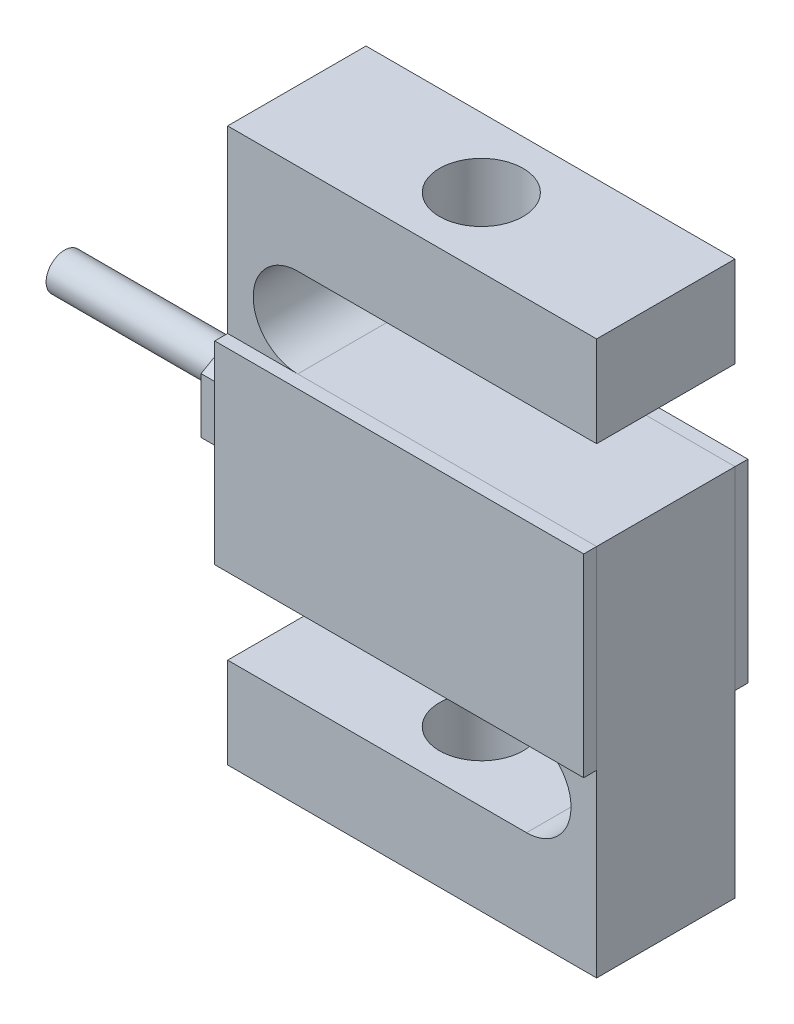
ISO-10303-21;
HEADER;
FILE_DESCRIPTION(('STEP AP214'),'2;1');
FILE_NAME('part.step','',(''),(''),'','','');
FILE_SCHEMA(('AUTOMOTIVE_DESIGN { 1 0 10303 214 1 1 1 1 }'));
ENDSEC;
DATA;
#1=APPLICATION_CONTEXT('core data for automotive mechanical design processes');
#2=APPLICATION_PROTOCOL_DEFINITION('international standard','automotive_design',2000,#1);
#3=PRODUCT_CONTEXT('',#1,'mechanical');
#4=PRODUCT('Part','Part','',(#3));
#5=PRODUCT_RELATED_PRODUCT_CATEGORY('part','',(#4));
#6=PRODUCT_DEFINITION_FORMATION('','',#4);
#7=PRODUCT_DEFINITION_CONTEXT('part definition',#1,'design');
#8=PRODUCT_DEFINITION('design','',#6,#7);
#9=PRODUCT_DEFINITION_SHAPE('','',#8);
#10=(LENGTH_UNIT() NAMED_UNIT(*) SI_UNIT(.MILLI.,.METRE.));
#11=(NAMED_UNIT(*) PLANE_ANGLE_UNIT() SI_UNIT($,.RADIAN.));
#12=(NAMED_UNIT(*) SI_UNIT($,.STERADIAN.) SOLID_ANGLE_UNIT());
#13=UNCERTAINTY_MEASURE_WITH_UNIT(LENGTH_MEASURE(1.E-05),#10,'distance_accuracy_value','');
#14=(GEOMETRIC_REPRESENTATION_CONTEXT(3) GLOBAL_UNCERTAINTY_ASSIGNED_CONTEXT((#13)) GLOBAL_UNIT_ASSIGNED_CONTEXT((#10,
#11,#12)) REPRESENTATION_CONTEXT('',''));
#15=CARTESIAN_POINT('',(0.,0.,0.));
#16=DIRECTION('',(0.,0.,1.));
#17=DIRECTION('',(1.,0.,0.));
#18=AXIS2_PLACEMENT_3D('',#15,#16,#17);
#19=CARTESIAN_POINT('',(25.4,13.3499999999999,-11.303));
#20=DIRECTION('',(-1.,0.,0.));
#21=DIRECTION('',(0.,-1.,0.));
#22=AXIS2_PLACEMENT_3D('',#19,#20,#21);
#23=PLANE('',#22);
#24=DIRECTION('',(0.,-1.,0.));
#25=VECTOR('',#24,1.);
#26=CARTESIAN_POINT('',(25.4,13.3499999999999,-9.525));
#27=LINE('',#26,#25);
#28=CARTESIAN_POINT('',(25.4,13.3499999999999,-9.525));
#29=VERTEX_POINT('',#28);
#30=CARTESIAN_POINT('',(25.4,-13.35,-9.525));
#31=VERTEX_POINT('',#30);
#32=EDGE_CURVE('E108',#29,#31,#27,.T.);
#33=ORIENTED_EDGE('',*,*,#32,.T.);
#34=DIRECTION('',(0.,0.,1.));
#35=VECTOR('',#34,1.);
#36=CARTESIAN_POINT('',(25.4,-13.35,-11.303));
#37=LINE('',#36,#35);
#38=CARTESIAN_POINT('',(25.4,-13.35,-11.303));
#39=VERTEX_POINT('',#38);
#40=EDGE_CURVE('E12',#39,#31,#37,.T.);
#41=ORIENTED_EDGE('',*,*,#40,.F.);
#42=DIRECTION('',(0.,-1.,0.));
#43=VECTOR('',#42,1.);
#44=CARTESIAN_POINT('',(25.4,13.3499999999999,-11.303));
#45=LINE('',#44,#43);
#46=CARTESIAN_POINT('',(25.4,13.3499999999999,-11.303));
#47=VERTEX_POINT('',#46);
#48=EDGE_CURVE('E96',#47,#39,#45,.T.);
#49=ORIENTED_EDGE('',*,*,#48,.F.);
#50=DIRECTION('',(0.,0.,1.));
#51=VECTOR('',#50,1.);
#52=CARTESIAN_POINT('',(25.4,13.3499999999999,-11.303));
#53=LINE('',#52,#51);
#54=EDGE_CURVE('E104',#47,#29,#53,.T.);
#55=ORIENTED_EDGE('',*,*,#54,.T.);
#56=EDGE_LOOP('',(#33,#41,#49,#55));
#57=FACE_BOUND('',#56,.T.);
#58=ADVANCED_FACE('F45',(#57),#23,.F.);
#59=CARTESIAN_POINT('',(25.4,-13.35,-11.303));
#60=DIRECTION('',(0.,1.,0.));
#61=DIRECTION('',(0.,0.,1.));
#62=AXIS2_PLACEMENT_3D('',#59,#60,#61);
#63=PLANE('',#62);
#64=DIRECTION('',(-1.,0.,0.));
#65=VECTOR('',#64,1.);
#66=CARTESIAN_POINT('',(25.4,-13.35,-9.525));
#67=LINE('',#66,#65);
#68=CARTESIAN_POINT('',(-25.4,-13.35,-9.525));
#69=VERTEX_POINT('',#68);
#70=EDGE_CURVE('E100',#31,#69,#67,.T.);
#71=ORIENTED_EDGE('',*,*,#70,.T.);
#72=DIRECTION('',(0.,0.,1.));
#73=VECTOR('',#72,1.);
#74=CARTESIAN_POINT('',(-25.4,-13.35,-11.303));
#75=LINE('',#74,#73);
#76=CARTESIAN_POINT('',(-25.4,-13.35,-11.303));
#77=VERTEX_POINT('',#76);
#78=EDGE_CURVE('E53',#77,#69,#75,.T.);
#79=ORIENTED_EDGE('',*,*,#78,.F.);
#80=DIRECTION('',(-1.,0.,0.));
#81=VECTOR('',#80,1.);
#82=CARTESIAN_POINT('',(25.4,-13.35,-11.303));
#83=LINE('',#82,#81);
#84=EDGE_CURVE('E91',#39,#77,#83,.T.);
#85=ORIENTED_EDGE('',*,*,#84,.F.);
#86=ORIENTED_EDGE('',*,*,#40,.T.);
#87=EDGE_LOOP('',(#71,#79,#85,#86));
#88=FACE_BOUND('',#87,.T.);
#89=ADVANCED_FACE('F99',(#88),#63,.F.);
#90=CARTESIAN_POINT('',(-25.4,13.3499999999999,-11.303));
#91=DIRECTION('',(1.,0.,0.));
#92=DIRECTION('',(0.,1.,0.));
#93=AXIS2_PLACEMENT_3D('',#90,#91,#92);
#94=PLANE('',#93);
#95=DIRECTION('',(0.,1.,0.));
#96=VECTOR('',#95,1.);
#97=CARTESIAN_POINT('',(-25.4,13.3499999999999,-9.525));
#98=LINE('',#97,#96);
#99=CARTESIAN_POINT('',(-25.4,13.3499999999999,-9.525));
#100=VERTEX_POINT('',#99);
#101=EDGE_CURVE('E78',#69,#100,#98,.T.);
#102=ORIENTED_EDGE('',*,*,#101,.T.);
#103=DIRECTION('',(0.,0.,1.));
#104=VECTOR('',#103,1.);
#105=CARTESIAN_POINT('',(-25.4,13.3499999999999,-11.303));
#106=LINE('',#105,#104);
#107=CARTESIAN_POINT('',(-25.4,13.3499999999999,-11.303));
#108=VERTEX_POINT('',#107);
#109=EDGE_CURVE('E101',#108,#100,#106,.T.);
#110=ORIENTED_EDGE('',*,*,#109,.F.);
#111=DIRECTION('',(0.,1.,0.));
#112=VECTOR('',#111,1.);
#113=CARTESIAN_POINT('',(-25.4,13.3499999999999,-11.303));
#114=LINE('',#113,#112);
#115=EDGE_CURVE('E94',#77,#108,#114,.T.);
#116=ORIENTED_EDGE('',*,*,#115,.F.);
#117=ORIENTED_EDGE('',*,*,#78,.T.);
#118=EDGE_LOOP('',(#102,#110,#116,#117));
#119=FACE_BOUND('',#118,.T.);
#120=ADVANCED_FACE('F102',(#119),#94,.F.);
#121=CARTESIAN_POINT('',(25.4,13.3499999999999,-11.303));
#122=DIRECTION('',(0.,-1.,0.));
#123=DIRECTION('',(0.,0.,-1.));
#124=AXIS2_PLACEMENT_3D('',#121,#122,#123);
#125=PLANE('',#124);
#126=DIRECTION('',(1.,0.,0.));
#127=VECTOR('',#126,1.);
#128=CARTESIAN_POINT('',(25.4,13.3499999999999,-9.525));
#129=LINE('',#128,#127);
#130=EDGE_CURVE('E84',#100,#29,#129,.T.);
#131=ORIENTED_EDGE('',*,*,#130,.T.);
#132=ORIENTED_EDGE('',*,*,#54,.F.);
#133=DIRECTION('',(1.,0.,0.));
#134=VECTOR('',#133,1.);
#135=CARTESIAN_POINT('',(25.4,13.3499999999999,-11.303));
#136=LINE('',#135,#134);
#137=EDGE_CURVE('E61',#108,#47,#136,.T.);
#138=ORIENTED_EDGE('',*,*,#137,.F.);
#139=ORIENTED_EDGE('',*,*,#109,.T.);
#140=EDGE_LOOP('',(#131,#132,#138,#139));
#141=FACE_BOUND('',#140,.T.);
#142=ADVANCED_FACE('F115',(#141),#125,.F.);
#143=CARTESIAN_POINT('',(25.4,-13.35,-11.303));
#144=DIRECTION('',(0.,0.,-1.));
#145=DIRECTION('',(-1.,0.,0.));
#146=AXIS2_PLACEMENT_3D('',#143,#144,#145);
#147=PLANE('',#146);
#148=ORIENTED_EDGE('',*,*,#48,.T.);
#149=ORIENTED_EDGE('',*,*,#84,.T.);
#150=ORIENTED_EDGE('',*,*,#115,.T.);
#151=ORIENTED_EDGE('',*,*,#137,.T.);
#152=EDGE_LOOP('',(#148,#149,#150,#151));
#153=FACE_BOUND('',#152,.T.);
#154=ADVANCED_FACE('F92',(#153),#147,.T.);
#155=CARTESIAN_POINT('',(25.4,-13.35,-9.525));
#156=DIRECTION('',(0.,0.,-1.));
#157=DIRECTION('',(-1.,0.,0.));
#158=AXIS2_PLACEMENT_3D('',#155,#156,#157);
#159=PLANE('',#158);
#160=ORIENTED_EDGE('',*,*,#32,.F.);
#161=ORIENTED_EDGE('',*,*,#130,.F.);
#162=ORIENTED_EDGE('',*,*,#101,.F.);
#163=ORIENTED_EDGE('',*,*,#70,.F.);
#164=EDGE_LOOP('',(#160,#161,#162,#163));
#165=FACE_BOUND('',#164,.T.);
#166=ADVANCED_FACE('F118',(#165),#159,.F.);
#167=CLOSED_SHELL('',(#58,#89,#120,#142,#154,#166));
#168=MANIFOLD_SOLID_BREP('B2',#167);
#169=CARTESIAN_POINT('',(25.4,13.3499999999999,11.303));
#170=DIRECTION('',(-1.,0.,0.));
#171=DIRECTION('',(0.,0.,1.));
#172=AXIS2_PLACEMENT_3D('',#169,#170,#171);
#173=PLANE('',#172);
#174=DIRECTION('',(0.,1.,0.));
#175=VECTOR('',#174,1.);
#176=CARTESIAN_POINT('',(25.4,13.3499999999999,9.525));
#177=LINE('',#176,#175);
#178=CARTESIAN_POINT('',(25.4,-13.335,9.525));
#179=VERTEX_POINT('',#178);
#180=CARTESIAN_POINT('',(25.4,13.3499999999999,9.525));
#181=VERTEX_POINT('',#180);
#182=EDGE_CURVE('E240',#179,#181,#177,.T.);
#183=ORIENTED_EDGE('',*,*,#182,.T.);
#184=DIRECTION('',(0.,0.,-1.));
#185=VECTOR('',#184,1.);
#186=CARTESIAN_POINT('',(25.4,13.3499999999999,11.303));
#187=LINE('',#186,#185);
#188=CARTESIAN_POINT('',(25.4,13.3499999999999,11.303));
#189=VERTEX_POINT('',#188);
#190=EDGE_CURVE('E43',#189,#181,#187,.T.);
#191=ORIENTED_EDGE('',*,*,#190,.F.);
#192=DIRECTION('',(0.,1.,0.));
#193=VECTOR('',#192,1.);
#194=CARTESIAN_POINT('',(25.4,13.3499999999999,11.303));
#195=LINE('',#194,#193);
#196=CARTESIAN_POINT('',(25.4,-13.335,11.303));
#197=VERTEX_POINT('',#196);
#198=EDGE_CURVE('E228',#197,#189,#195,.T.);
#199=ORIENTED_EDGE('',*,*,#198,.F.);
#200=DIRECTION('',(0.,0.,-1.));
#201=VECTOR('',#200,1.);
#202=CARTESIAN_POINT('',(25.4,-13.335,11.303));
#203=LINE('',#202,#201);
#204=EDGE_CURVE('E236',#197,#179,#203,.T.);
#205=ORIENTED_EDGE('',*,*,#204,.T.);
#206=EDGE_LOOP('',(#183,#191,#199,#205));
#207=FACE_BOUND('',#206,.T.);
#208=ADVANCED_FACE('F177',(#207),#173,.F.);
#209=CARTESIAN_POINT('',(25.4,13.3499999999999,11.303));
#210=DIRECTION('',(0.,-1.,0.));
#211=DIRECTION('',(1.,0.,0.));
#212=AXIS2_PLACEMENT_3D('',#209,#210,#211);
#213=PLANE('',#212);
#214=DIRECTION('',(-1.,0.,0.));
#215=VECTOR('',#214,1.);
#216=CARTESIAN_POINT('',(25.4,13.3499999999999,9.525));
#217=LINE('',#216,#215);
#218=CARTESIAN_POINT('',(-25.4,13.3499999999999,9.525));
#219=VERTEX_POINT('',#218);
#220=EDGE_CURVE('E232',#181,#219,#217,.T.);
#221=ORIENTED_EDGE('',*,*,#220,.T.);
#222=DIRECTION('',(0.,0.,-1.));
#223=VECTOR('',#222,1.);
#224=CARTESIAN_POINT('',(-25.4,13.3499999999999,11.303));
#225=LINE('',#224,#223);
#226=CARTESIAN_POINT('',(-25.4,13.3499999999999,11.303));
#227=VERTEX_POINT('',#226);
#228=EDGE_CURVE('E185',#227,#219,#225,.T.);
#229=ORIENTED_EDGE('',*,*,#228,.F.);
#230=DIRECTION('',(-1.,0.,0.));
#231=VECTOR('',#230,1.);
#232=CARTESIAN_POINT('',(25.4,13.3499999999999,11.303));
#233=LINE('',#232,#231);
#234=EDGE_CURVE('E223',#189,#227,#233,.T.);
#235=ORIENTED_EDGE('',*,*,#234,.F.);
#236=ORIENTED_EDGE('',*,*,#190,.T.);
#237=EDGE_LOOP('',(#221,#229,#235,#236));
#238=FACE_BOUND('',#237,.T.);
#239=ADVANCED_FACE('F231',(#238),#213,.F.);
#240=CARTESIAN_POINT('',(-25.4,13.3499999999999,11.303));
#241=DIRECTION('',(1.,0.,0.));
#242=DIRECTION('',(0.,1.,0.));
#243=AXIS2_PLACEMENT_3D('',#240,#241,#242);
#244=PLANE('',#243);
#245=DIRECTION('',(0.,-1.,0.));
#246=VECTOR('',#245,1.);
#247=CARTESIAN_POINT('',(-25.4,13.3499999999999,9.525));
#248=LINE('',#247,#246);
#249=CARTESIAN_POINT('',(-25.4,-13.335,9.525));
#250=VERTEX_POINT('',#249);
#251=EDGE_CURVE('E210',#219,#250,#248,.T.);
#252=ORIENTED_EDGE('',*,*,#251,.T.);
#253=DIRECTION('',(0.,0.,-1.));
#254=VECTOR('',#253,1.);
#255=CARTESIAN_POINT('',(-25.4,-13.335,11.303));
#256=LINE('',#255,#254);
#257=CARTESIAN_POINT('',(-25.4,-13.335,11.303));
#258=VERTEX_POINT('',#257);
#259=EDGE_CURVE('E233',#258,#250,#256,.T.);
#260=ORIENTED_EDGE('',*,*,#259,.F.);
#261=DIRECTION('',(0.,-1.,0.));
#262=VECTOR('',#261,1.);
#263=CARTESIAN_POINT('',(-25.4,13.3499999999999,11.303));
#264=LINE('',#263,#262);
#265=EDGE_CURVE('E226',#227,#258,#264,.T.);
#266=ORIENTED_EDGE('',*,*,#265,.F.);
#267=ORIENTED_EDGE('',*,*,#228,.T.);
#268=EDGE_LOOP('',(#252,#260,#266,#267));
#269=FACE_BOUND('',#268,.T.);
#270=ADVANCED_FACE('F234',(#269),#244,.F.);
#271=CARTESIAN_POINT('',(25.4,-13.335,11.303));
#272=DIRECTION('',(0.,1.,0.));
#273=DIRECTION('',(0.,0.,1.));
#274=AXIS2_PLACEMENT_3D('',#271,#272,#273);
#275=PLANE('',#274);
#276=DIRECTION('',(1.,0.,0.));
#277=VECTOR('',#276,1.);
#278=CARTESIAN_POINT('',(25.4,-13.335,9.525));
#279=LINE('',#278,#277);
#280=EDGE_CURVE('E216',#250,#179,#279,.T.);
#281=ORIENTED_EDGE('',*,*,#280,.T.);
#282=ORIENTED_EDGE('',*,*,#204,.F.);
#283=DIRECTION('',(1.,0.,0.));
#284=VECTOR('',#283,1.);
#285=CARTESIAN_POINT('',(25.4,-13.335,11.303));
#286=LINE('',#285,#284);
#287=EDGE_CURVE('E193',#258,#197,#286,.T.);
#288=ORIENTED_EDGE('',*,*,#287,.F.);
#289=ORIENTED_EDGE('',*,*,#259,.T.);
#290=EDGE_LOOP('',(#281,#282,#288,#289));
#291=FACE_BOUND('',#290,.T.);
#292=ADVANCED_FACE('F247',(#291),#275,.F.);
#293=CARTESIAN_POINT('',(25.4,-13.335,11.303));
#294=DIRECTION('',(0.,0.,-1.));
#295=DIRECTION('',(-1.,0.,0.));
#296=AXIS2_PLACEMENT_3D('',#293,#294,#295);
#297=PLANE('',#296);
#298=ORIENTED_EDGE('',*,*,#198,.T.);
#299=ORIENTED_EDGE('',*,*,#234,.T.);
#300=ORIENTED_EDGE('',*,*,#265,.T.);
#301=ORIENTED_EDGE('',*,*,#287,.T.);
#302=EDGE_LOOP('',(#298,#299,#300,#301));
#303=FACE_BOUND('',#302,.T.);
#304=ADVANCED_FACE('F224',(#303),#297,.F.);
#305=CARTESIAN_POINT('',(25.4,-13.335,9.525));
#306=DIRECTION('',(0.,0.,-1.));
#307=DIRECTION('',(-1.,0.,0.));
#308=AXIS2_PLACEMENT_3D('',#305,#306,#307);
#309=PLANE('',#308);
#310=ORIENTED_EDGE('',*,*,#182,.F.);
#311=ORIENTED_EDGE('',*,*,#280,.F.);
#312=ORIENTED_EDGE('',*,*,#251,.F.);
#313=ORIENTED_EDGE('',*,*,#220,.F.);
#314=EDGE_LOOP('',(#310,#311,#312,#313));
#315=FACE_BOUND('',#314,.T.);
#316=ADVANCED_FACE('F250',(#315),#309,.T.);
#317=CLOSED_SHELL('',(#208,#239,#270,#292,#304,#316));
#318=MANIFOLD_SOLID_BREP('B6',#317);
#319=CARTESIAN_POINT('',(25.4,38.1,9.525));
#320=DIRECTION('',(0.,-1.,0.));
#321=DIRECTION('',(1.,0.,0.));
#322=AXIS2_PLACEMENT_3D('',#319,#320,#321);
#323=PLANE('',#322);
#324=DIRECTION('',(-1.,0.,0.));
#325=VECTOR('',#324,1.);
#326=CARTESIAN_POINT('',(25.4,38.1,-9.525));
#327=LINE('',#326,#325);
#328=CARTESIAN_POINT('',(25.4,38.1,-9.525));
#329=VERTEX_POINT('',#328);
#330=CARTESIAN_POINT('',(-25.4,38.1,-9.525));
#331=VERTEX_POINT('',#330);
#332=EDGE_CURVE('E442',#329,#331,#327,.T.);
#333=ORIENTED_EDGE('',*,*,#332,.T.);
#334=DIRECTION('',(0.,0.,-1.));
#335=VECTOR('',#334,1.);
#336=CARTESIAN_POINT('',(-25.4,38.1,9.525));
#337=LINE('',#336,#335);
#338=CARTESIAN_POINT('',(-25.4,38.1,9.525));
#339=VERTEX_POINT('',#338);
#340=EDGE_CURVE('E453',#339,#331,#337,.T.);
#341=ORIENTED_EDGE('',*,*,#340,.F.);
#342=DIRECTION('',(-1.,0.,0.));
#343=VECTOR('',#342,1.);
#344=CARTESIAN_POINT('',(25.4,38.1,9.525));
#345=LINE('',#344,#343);
#346=CARTESIAN_POINT('',(25.4,38.1,9.525));
#347=VERTEX_POINT('',#346);
#348=EDGE_CURVE('E504',#347,#339,#345,.T.);
#349=ORIENTED_EDGE('',*,*,#348,.F.);
#350=DIRECTION('',(0.,0.,-1.));
#351=VECTOR('',#350,1.);
#352=CARTESIAN_POINT('',(25.4,38.1,9.525));
#353=LINE('',#352,#351);
#354=EDGE_CURVE('E456',#347,#329,#353,.T.);
#355=ORIENTED_EDGE('',*,*,#354,.T.);
#356=EDGE_LOOP('',(#333,#341,#349,#355));
#357=FACE_BOUND('',#356,.T.);
#358=CARTESIAN_POINT('',(0.,38.1,0.));
#359=DIRECTION('',(0.,1.,0.));
#360=DIRECTION('',(0.,0.,1.));
#361=AXIS2_PLACEMENT_3D('',#358,#359,#360);
#362=CIRCLE('',#361,5.75436999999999);
#363=CARTESIAN_POINT('',(0.,38.1,5.75436999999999));
#364=VERTEX_POINT('',#363);
#365=EDGE_CURVE('E622',#364,#364,#362,.T.);
#366=ORIENTED_EDGE('',*,*,#365,.F.);
#367=EDGE_LOOP('',(#366));
#368=FACE_BOUND('',#367,.T.);
#369=ADVANCED_FACE('F300',(#357,#368),#323,.F.);
#370=CARTESIAN_POINT('',(-31.98,7.62,0.));
#371=DIRECTION('',(-1.,0.,0.));
#372=DIRECTION('',(0.,0.,1.));
#373=AXIS2_PLACEMENT_3D('',#370,#371,#372);
#374=PLANE('',#373);
#375=DIRECTION('',(0.,0.5,-0.866025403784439));
#376=VECTOR('',#375,1.);
#377=CARTESIAN_POINT('',(-31.98,3.81,6.59911357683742));
#378=LINE('',#377,#376);
#379=CARTESIAN_POINT('',(-31.98,3.81,6.59911357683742));
#380=VERTEX_POINT('',#379);
#381=CARTESIAN_POINT('',(-31.98,7.62,0.));
#382=VERTEX_POINT('',#381);
#383=EDGE_CURVE('E637',#380,#382,#378,.T.);
#384=ORIENTED_EDGE('',*,*,#383,.T.);
#385=DIRECTION('',(0.,-0.5,-0.866025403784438));
#386=VECTOR('',#385,1.);
#387=CARTESIAN_POINT('',(-31.98,7.62,0.));
#388=LINE('',#387,#386);
#389=CARTESIAN_POINT('',(-31.98,3.81,-6.59911357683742));
#390=VERTEX_POINT('',#389);
#391=EDGE_CURVE('E640',#382,#390,#388,.T.);
#392=ORIENTED_EDGE('',*,*,#391,.T.);
#393=DIRECTION('',(0.,-1.,0.));
#394=VECTOR('',#393,1.);
#395=CARTESIAN_POINT('',(-31.98,3.81,-6.59911357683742));
#396=LINE('',#395,#394);
#397=CARTESIAN_POINT('',(-31.98,-3.81,-6.59911357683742));
#398=VERTEX_POINT('',#397);
#399=EDGE_CURVE('E644',#390,#398,#396,.T.);
#400=ORIENTED_EDGE('',*,*,#399,.T.);
#401=DIRECTION('',(0.,-0.5,0.866025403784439));
#402=VECTOR('',#401,1.);
#403=CARTESIAN_POINT('',(-31.98,-3.81,-6.59911357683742));
#404=LINE('',#403,#402);
#405=CARTESIAN_POINT('',(-31.98,-7.62,0.));
#406=VERTEX_POINT('',#405);
#407=EDGE_CURVE('E647',#398,#406,#404,.T.);
#408=ORIENTED_EDGE('',*,*,#407,.T.);
#409=DIRECTION('',(0.,0.5,0.866025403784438));
#410=VECTOR('',#409,1.);
#411=CARTESIAN_POINT('',(-31.98,-7.62,0.));
#412=LINE('',#411,#410);
#413=CARTESIAN_POINT('',(-31.98,-3.81,6.59911357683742));
#414=VERTEX_POINT('',#413);
#415=EDGE_CURVE('E650',#406,#414,#412,.T.);
#416=ORIENTED_EDGE('',*,*,#415,.T.);
#417=DIRECTION('',(0.,1.,0.));
#418=VECTOR('',#417,1.);
#419=CARTESIAN_POINT('',(-31.98,-3.81,6.59911357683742));
#420=LINE('',#419,#418);
#421=EDGE_CURVE('E653',#414,#380,#420,.T.);
#422=ORIENTED_EDGE('',*,*,#421,.T.);
#423=EDGE_LOOP('',(#384,#392,#400,#408,#416,#422));
#424=FACE_BOUND('',#423,.T.);
#425=CARTESIAN_POINT('',(-31.98,0.,0.));
#426=DIRECTION('',(-1.,0.,0.));
#427=DIRECTION('',(0.,0.,1.));
#428=AXIS2_PLACEMENT_3D('',#425,#426,#427);
#429=CIRCLE('',#428,2.54);
#430=CARTESIAN_POINT('',(-31.98,0.,2.54));
#431=VERTEX_POINT('',#430);
#432=EDGE_CURVE('E630',#431,#431,#429,.T.);
#433=ORIENTED_EDGE('',*,*,#432,.F.);
#434=EDGE_LOOP('',(#433));
#435=FACE_BOUND('',#434,.T.);
#436=ADVANCED_FACE('F537',(#424,#435),#374,.T.);
#437=CARTESIAN_POINT('',(-25.4,38.1,9.525));
#438=DIRECTION('',(1.,0.,0.));
#439=DIRECTION('',(0.,1.,0.));
#440=AXIS2_PLACEMENT_3D('',#437,#438,#439);
#441=PLANE('',#440);
#442=DIRECTION('',(0.,-1.,0.));
#443=VECTOR('',#442,1.);
#444=CARTESIAN_POINT('',(-25.4,38.1,-9.525));
#445=LINE('',#444,#443);
#446=CARTESIAN_POINT('',(-25.4,-13.35,-9.525));
#447=VERTEX_POINT('',#446);
#448=EDGE_CURVE('E444',#331,#447,#445,.T.);
#449=ORIENTED_EDGE('',*,*,#448,.T.);
#450=DIRECTION('',(0.,0.,-1.));
#451=VECTOR('',#450,1.);
#452=CARTESIAN_POINT('',(-25.4,-13.35,9.525));
#453=LINE('',#452,#451);
#454=CARTESIAN_POINT('',(-25.4,-13.35,9.525));
#455=VERTEX_POINT('',#454);
#456=EDGE_CURVE('E417',#455,#447,#453,.T.);
#457=ORIENTED_EDGE('',*,*,#456,.F.);
#458=DIRECTION('',(0.,-1.,0.));
#459=VECTOR('',#458,1.);
#460=CARTESIAN_POINT('',(-25.4,38.1,9.525));
#461=LINE('',#460,#459);
#462=EDGE_CURVE('E408',#339,#455,#461,.T.);
#463=ORIENTED_EDGE('',*,*,#462,.F.);
#464=ORIENTED_EDGE('',*,*,#340,.T.);
#465=EDGE_LOOP('',(#449,#457,#463,#464));
#466=FACE_BOUND('',#465,.T.);
#467=CARTESIAN_POINT('',(-25.4,0.,0.));
#468=DIRECTION('',(1.,0.,0.));
#469=DIRECTION('',(0.,1.,0.));
#470=AXIS2_PLACEMENT_3D('',#467,#468,#469);
#471=CIRCLE('',#470,6.35);
#472=CARTESIAN_POINT('',(-25.4,6.35,0.));
#473=VERTEX_POINT('',#472);
#474=EDGE_CURVE('E175',#473,#473,#471,.F.);
#475=ORIENTED_EDGE('',*,*,#474,.F.);
#476=EDGE_LOOP('',(#475));
#477=FACE_BOUND('',#476,.T.);
#478=ADVANCED_FACE('F514',(#466,#477),#441,.F.);
#479=CARTESIAN_POINT('',(-25.4,-25.6,9.525));
#480=DIRECTION('',(1.,0.,0.));
#481=DIRECTION('',(0.,1.,0.));
#482=AXIS2_PLACEMENT_3D('',#479,#480,#481);
#483=PLANE('',#482);
#484=DIRECTION('',(0.,-1.,0.));
#485=VECTOR('',#484,1.);
#486=CARTESIAN_POINT('',(-25.4,-25.6,-9.525));
#487=LINE('',#486,#485);
#488=CARTESIAN_POINT('',(-25.4,-25.6,-9.525));
#489=VERTEX_POINT('',#488);
#490=CARTESIAN_POINT('',(-25.4,-38.1,-9.525));
#491=VERTEX_POINT('',#490);
#492=EDGE_CURVE('E426',#489,#491,#487,.T.);
#493=ORIENTED_EDGE('',*,*,#492,.T.);
#494=DIRECTION('',(0.,0.,-1.));
#495=VECTOR('',#494,1.);
#496=CARTESIAN_POINT('',(-25.4,-38.1,9.525));
#497=LINE('',#496,#495);
#498=CARTESIAN_POINT('',(-25.4,-38.1,9.525));
#499=VERTEX_POINT('',#498);
#500=EDGE_CURVE('E309',#499,#491,#497,.T.);
#501=ORIENTED_EDGE('',*,*,#500,.F.);
#502=DIRECTION('',(0.,-1.,0.));
#503=VECTOR('',#502,1.);
#504=CARTESIAN_POINT('',(-25.4,-25.6,9.525));
#505=LINE('',#504,#503);
#506=CARTESIAN_POINT('',(-25.4,-25.6,9.525));
#507=VERTEX_POINT('',#506);
#508=EDGE_CURVE('E449',#507,#499,#505,.T.);
#509=ORIENTED_EDGE('',*,*,#508,.F.);
#510=DIRECTION('',(0.,0.,-1.));
#511=VECTOR('',#510,1.);
#512=CARTESIAN_POINT('',(-25.4,-25.6,9.525));
#513=LINE('',#512,#511);
#514=EDGE_CURVE('E422',#507,#489,#513,.T.);
#515=ORIENTED_EDGE('',*,*,#514,.T.);
#516=EDGE_LOOP('',(#493,#501,#509,#515));
#517=FACE_BOUND('',#516,.T.);
#518=ADVANCED_FACE('F302',(#517),#483,.F.);
#519=CARTESIAN_POINT('',(-25.4,-38.1,9.525));
#520=DIRECTION('',(0.,1.,0.));
#521=DIRECTION('',(0.,0.,1.));
#522=AXIS2_PLACEMENT_3D('',#519,#520,#521);
#523=PLANE('',#522);
#524=CARTESIAN_POINT('',(0.,-38.1,0.));
#525=DIRECTION('',(0.,-1.,0.));
#526=DIRECTION('',(0.,0.,-1.));
#527=AXIS2_PLACEMENT_3D('',#524,#525,#526);
#528=CIRCLE('',#527,5.75436999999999);
#529=CARTESIAN_POINT('',(0.,-38.1,-5.75436999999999));
#530=VERTEX_POINT('',#529);
#531=EDGE_CURVE('E619',#530,#530,#528,.T.);
#532=ORIENTED_EDGE('',*,*,#531,.F.);
#533=EDGE_LOOP('',(#532));
#534=FACE_BOUND('',#533,.T.);
#535=DIRECTION('',(1.,0.,0.));
#536=VECTOR('',#535,1.);
#537=CARTESIAN_POINT('',(-25.4,-38.1,-9.525));
#538=LINE('',#537,#536);
#539=CARTESIAN_POINT('',(25.4,-38.1,-9.525));
#540=VERTEX_POINT('',#539);
#541=EDGE_CURVE('E429',#491,#540,#538,.T.);
#542=ORIENTED_EDGE('',*,*,#541,.T.);
#543=DIRECTION('',(0.,0.,-1.));
#544=VECTOR('',#543,1.);
#545=CARTESIAN_POINT('',(25.4,-38.1,9.525));
#546=LINE('',#545,#544);
#547=CARTESIAN_POINT('',(25.4,-38.1,9.525));
#548=VERTEX_POINT('',#547);
#549=EDGE_CURVE('E471',#548,#540,#546,.T.);
#550=ORIENTED_EDGE('',*,*,#549,.F.);
#551=DIRECTION('',(1.,0.,0.));
#552=VECTOR('',#551,1.);
#553=CARTESIAN_POINT('',(-25.4,-38.1,9.525));
#554=LINE('',#553,#552);
#555=EDGE_CURVE('E374',#499,#548,#554,.T.);
#556=ORIENTED_EDGE('',*,*,#555,.F.);
#557=ORIENTED_EDGE('',*,*,#500,.T.);
#558=EDGE_LOOP('',(#542,#550,#556,#557));
#559=FACE_BOUND('',#558,.T.);
#560=ADVANCED_FACE('F474',(#534,#559),#523,.F.);
#561=CARTESIAN_POINT('',(25.4,-38.1,9.525));
#562=DIRECTION('',(-1.,0.,0.));
#563=DIRECTION('',(0.,0.,1.));
#564=AXIS2_PLACEMENT_3D('',#561,#562,#563);
#565=PLANE('',#564);
#566=DIRECTION('',(0.,1.,0.));
#567=VECTOR('',#566,1.);
#568=CARTESIAN_POINT('',(25.4,-38.1,-9.525));
#569=LINE('',#568,#567);
#570=CARTESIAN_POINT('',(25.4,13.3499999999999,-9.525));
#571=VERTEX_POINT('',#570);
#572=EDGE_CURVE('E432',#540,#571,#569,.T.);
#573=ORIENTED_EDGE('',*,*,#572,.T.);
#574=DIRECTION('',(0.,0.,-1.));
#575=VECTOR('',#574,1.);
#576=CARTESIAN_POINT('',(25.4,13.3499999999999,9.525));
#577=LINE('',#576,#575);
#578=CARTESIAN_POINT('',(25.4,13.3499999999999,9.525));
#579=VERTEX_POINT('',#578);
#580=EDGE_CURVE('E468',#579,#571,#577,.T.);
#581=ORIENTED_EDGE('',*,*,#580,.F.);
#582=DIRECTION('',(0.,1.,0.));
#583=VECTOR('',#582,1.);
#584=CARTESIAN_POINT('',(25.4,-38.1,9.525));
#585=LINE('',#584,#583);
#586=EDGE_CURVE('E494',#548,#579,#585,.T.);
#587=ORIENTED_EDGE('',*,*,#586,.F.);
#588=ORIENTED_EDGE('',*,*,#549,.T.);
#589=EDGE_LOOP('',(#573,#581,#587,#588));
#590=FACE_BOUND('',#589,.T.);
#591=ADVANCED_FACE('F485',(#590),#565,.F.);
#592=CARTESIAN_POINT('',(-15.748,13.3499999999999,9.525));
#593=DIRECTION('',(0.,-1.,0.));
#594=DIRECTION('',(0.,0.,-1.));
#595=AXIS2_PLACEMENT_3D('',#592,#593,#594);
#596=PLANE('',#595);
#597=DIRECTION('',(-1.,0.,0.));
#598=VECTOR('',#597,1.);
#599=CARTESIAN_POINT('',(-15.748,13.3499999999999,-9.525));
#600=LINE('',#599,#598);
#601=CARTESIAN_POINT('',(-15.748,13.3499999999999,-9.525));
#602=VERTEX_POINT('',#601);
#603=EDGE_CURVE('E434',#571,#602,#600,.T.);
#604=ORIENTED_EDGE('',*,*,#603,.T.);
#605=DIRECTION('',(0.,0.,-1.));
#606=VECTOR('',#605,1.);
#607=CARTESIAN_POINT('',(-15.748,13.3499999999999,9.525));
#608=LINE('',#607,#606);
#609=CARTESIAN_POINT('',(-15.748,13.3499999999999,9.525));
#610=VERTEX_POINT('',#609);
#611=EDGE_CURVE('E465',#610,#602,#608,.T.);
#612=ORIENTED_EDGE('',*,*,#611,.F.);
#613=DIRECTION('',(-1.,0.,0.));
#614=VECTOR('',#613,1.);
#615=CARTESIAN_POINT('',(-15.748,13.3499999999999,9.525));
#616=LINE('',#615,#614);
#617=EDGE_CURVE('E491',#579,#610,#616,.T.);
#618=ORIENTED_EDGE('',*,*,#617,.F.);
#619=ORIENTED_EDGE('',*,*,#580,.T.);
#620=EDGE_LOOP('',(#604,#612,#618,#619));
#621=FACE_BOUND('',#620,.T.);
#622=ADVANCED_FACE('F489',(#621),#596,.F.);
#623=CARTESIAN_POINT('',(-15.748,19.475,9.525));
#624=DIRECTION('',(0.,0.,-1.));
#625=DIRECTION('',(-1.,0.,0.));
#626=AXIS2_PLACEMENT_3D('',#623,#624,#625);
#627=CYLINDRICAL_SURFACE('',#626,6.12500000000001);
#628=CARTESIAN_POINT('',(-15.748,19.475,-9.525));
#629=DIRECTION('',(0.,0.,-1.));
#630=DIRECTION('',(1.,0.,0.));
#631=AXIS2_PLACEMENT_3D('',#628,#629,#630);
#632=CIRCLE('',#631,6.12500000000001);
#633=CARTESIAN_POINT('',(-15.748,25.6,-9.525));
#634=VERTEX_POINT('',#633);
#635=EDGE_CURVE('E436',#602,#634,#632,.T.);
#636=ORIENTED_EDGE('',*,*,#635,.T.);
#637=DIRECTION('',(0.,0.,-1.));
#638=VECTOR('',#637,1.);
#639=CARTESIAN_POINT('',(-15.748,25.6,9.525));
#640=LINE('',#639,#638);
#641=CARTESIAN_POINT('',(-15.748,25.6,9.525));
#642=VERTEX_POINT('',#641);
#643=EDGE_CURVE('E462',#642,#634,#640,.T.);
#644=ORIENTED_EDGE('',*,*,#643,.F.);
#645=CARTESIAN_POINT('',(-15.748,19.475,9.525));
#646=DIRECTION('',(0.,0.,-1.));
#647=DIRECTION('',(1.,0.,0.));
#648=AXIS2_PLACEMENT_3D('',#645,#646,#647);
#649=CIRCLE('',#648,6.12500000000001);
#650=EDGE_CURVE('E493',#610,#642,#649,.T.);
#651=ORIENTED_EDGE('',*,*,#650,.F.);
#652=ORIENTED_EDGE('',*,*,#611,.T.);
#653=EDGE_LOOP('',(#636,#644,#651,#652));
#654=FACE_BOUND('',#653,.T.);
#655=ADVANCED_FACE('F526',(#654),#627,.F.);
#656=CARTESIAN_POINT('',(-15.748,25.6,9.525));
#657=DIRECTION('',(0.,1.,0.));
#658=DIRECTION('',(-1.,0.,0.));
#659=AXIS2_PLACEMENT_3D('',#656,#657,#658);
#660=PLANE('',#659);
#661=CARTESIAN_POINT('',(0.,25.6,0.));
#662=DIRECTION('',(0.,1.,0.));
#663=DIRECTION('',(-1.,0.,0.));
#664=AXIS2_PLACEMENT_3D('',#661,#662,#663);
#665=CIRCLE('',#664,5.75436999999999);
#666=CARTESIAN_POINT('',(-5.75436999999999,25.6,0.));
#667=VERTEX_POINT('',#666);
#668=EDGE_CURVE('E627',#667,#667,#665,.T.);
#669=ORIENTED_EDGE('',*,*,#668,.T.);
#670=EDGE_LOOP('',(#669));
#671=FACE_BOUND('',#670,.T.);
#672=DIRECTION('',(1.,0.,0.));
#673=VECTOR('',#672,1.);
#674=CARTESIAN_POINT('',(-15.748,25.6,-9.525));
#675=LINE('',#674,#673);
#676=CARTESIAN_POINT('',(25.4,25.6,-9.525));
#677=VERTEX_POINT('',#676);
#678=EDGE_CURVE('E438',#634,#677,#675,.T.);
#679=ORIENTED_EDGE('',*,*,#678,.T.);
#680=DIRECTION('',(0.,0.,-1.));
#681=VECTOR('',#680,1.);
#682=CARTESIAN_POINT('',(25.4,25.6,9.525));
#683=LINE('',#682,#681);
#684=CARTESIAN_POINT('',(25.4,25.6,9.525));
#685=VERTEX_POINT('',#684);
#686=EDGE_CURVE('E459',#685,#677,#683,.T.);
#687=ORIENTED_EDGE('',*,*,#686,.F.);
#688=DIRECTION('',(1.,0.,0.));
#689=VECTOR('',#688,1.);
#690=CARTESIAN_POINT('',(-15.748,25.6,9.525));
#691=LINE('',#690,#689);
#692=EDGE_CURVE('E496',#642,#685,#691,.T.);
#693=ORIENTED_EDGE('',*,*,#692,.F.);
#694=ORIENTED_EDGE('',*,*,#643,.T.);
#695=EDGE_LOOP('',(#679,#687,#693,#694));
#696=FACE_BOUND('',#695,.T.);
#697=ADVANCED_FACE('F523',(#671,#696),#660,.F.);
#698=CARTESIAN_POINT('',(25.4,25.6,9.525));
#699=DIRECTION('',(-1.,0.,0.));
#700=DIRECTION('',(0.,-1.,0.));
#701=AXIS2_PLACEMENT_3D('',#698,#699,#700);
#702=PLANE('',#701);
#703=DIRECTION('',(0.,1.,0.));
#704=VECTOR('',#703,1.);
#705=CARTESIAN_POINT('',(25.4,25.6,-9.525));
#706=LINE('',#705,#704);
#707=EDGE_CURVE('E440',#677,#329,#706,.T.);
#708=ORIENTED_EDGE('',*,*,#707,.T.);
#709=ORIENTED_EDGE('',*,*,#354,.F.);
#710=DIRECTION('',(0.,1.,0.));
#711=VECTOR('',#710,1.);
#712=CARTESIAN_POINT('',(25.4,25.6,9.525));
#713=LINE('',#712,#711);
#714=EDGE_CURVE('E502',#685,#347,#713,.T.);
#715=ORIENTED_EDGE('',*,*,#714,.F.);
#716=ORIENTED_EDGE('',*,*,#686,.T.);
#717=EDGE_LOOP('',(#708,#709,#715,#716));
#718=FACE_BOUND('',#717,.T.);
#719=ADVANCED_FACE('F519',(#718),#702,.F.);
#720=CARTESIAN_POINT('',(-25.4,-13.35,9.525));
#721=DIRECTION('',(0.,1.,0.));
#722=DIRECTION('',(-1.,0.,0.));
#723=AXIS2_PLACEMENT_3D('',#720,#721,#722);
#724=PLANE('',#723);
#725=DIRECTION('',(1.,0.,0.));
#726=VECTOR('',#725,1.);
#727=CARTESIAN_POINT('',(-25.4,-13.35,-9.525));
#728=LINE('',#727,#726);
#729=CARTESIAN_POINT('',(15.748,-13.35,-9.525));
#730=VERTEX_POINT('',#729);
#731=EDGE_CURVE('E416',#447,#730,#728,.T.);
#732=ORIENTED_EDGE('',*,*,#731,.T.);
#733=DIRECTION('',(0.,0.,-1.));
#734=VECTOR('',#733,1.);
#735=CARTESIAN_POINT('',(15.748,-13.35,9.525));
#736=LINE('',#735,#734);
#737=CARTESIAN_POINT('',(15.748,-13.35,9.525));
#738=VERTEX_POINT('',#737);
#739=EDGE_CURVE('E413',#738,#730,#736,.T.);
#740=ORIENTED_EDGE('',*,*,#739,.F.);
#741=DIRECTION('',(1.,0.,0.));
#742=VECTOR('',#741,1.);
#743=CARTESIAN_POINT('',(-25.4,-13.35,9.525));
#744=LINE('',#743,#742);
#745=EDGE_CURVE('E402',#455,#738,#744,.T.);
#746=ORIENTED_EDGE('',*,*,#745,.F.);
#747=ORIENTED_EDGE('',*,*,#456,.T.);
#748=EDGE_LOOP('',(#732,#740,#746,#747));
#749=FACE_BOUND('',#748,.T.);
#750=ADVANCED_FACE('F414',(#749),#724,.F.);
#751=CARTESIAN_POINT('',(15.748,-19.475,9.525));
#752=DIRECTION('',(0.,0.,-1.));
#753=DIRECTION('',(-1.,0.,0.));
#754=AXIS2_PLACEMENT_3D('',#751,#752,#753);
#755=CYLINDRICAL_SURFACE('',#754,6.12500000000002);
#756=CARTESIAN_POINT('',(15.748,-19.475,-9.525));
#757=DIRECTION('',(0.,0.,-1.));
#758=DIRECTION('',(1.,0.,0.));
#759=AXIS2_PLACEMENT_3D('',#756,#757,#758);
#760=CIRCLE('',#759,6.12500000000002);
#761=CARTESIAN_POINT('',(15.748,-25.6,-9.525));
#762=VERTEX_POINT('',#761);
#763=EDGE_CURVE('E359',#730,#762,#760,.T.);
#764=ORIENTED_EDGE('',*,*,#763,.T.);
#765=DIRECTION('',(0.,0.,-1.));
#766=VECTOR('',#765,1.);
#767=CARTESIAN_POINT('',(15.748,-25.6,9.525));
#768=LINE('',#767,#766);
#769=CARTESIAN_POINT('',(15.748,-25.6,9.525));
#770=VERTEX_POINT('',#769);
#771=EDGE_CURVE('E418',#770,#762,#768,.T.);
#772=ORIENTED_EDGE('',*,*,#771,.F.);
#773=CARTESIAN_POINT('',(15.748,-19.475,9.525));
#774=DIRECTION('',(0.,0.,-1.));
#775=DIRECTION('',(1.,0.,0.));
#776=AXIS2_PLACEMENT_3D('',#773,#774,#775);
#777=CIRCLE('',#776,6.12500000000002);
#778=EDGE_CURVE('E406',#738,#770,#777,.T.);
#779=ORIENTED_EDGE('',*,*,#778,.F.);
#780=ORIENTED_EDGE('',*,*,#739,.T.);
#781=EDGE_LOOP('',(#764,#772,#779,#780));
#782=FACE_BOUND('',#781,.T.);
#783=ADVANCED_FACE('F420',(#782),#755,.F.);
#784=CARTESIAN_POINT('',(-25.4,-25.6,9.525));
#785=DIRECTION('',(0.,-1.,0.));
#786=DIRECTION('',(1.,0.,0.));
#787=AXIS2_PLACEMENT_3D('',#784,#785,#786);
#788=PLANE('',#787);
#789=CARTESIAN_POINT('',(0.,-25.6,0.));
#790=DIRECTION('',(0.,-1.,0.));
#791=DIRECTION('',(1.,0.,0.));
#792=AXIS2_PLACEMENT_3D('',#789,#790,#791);
#793=CIRCLE('',#792,5.75436999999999);
#794=CARTESIAN_POINT('',(5.75436999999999,-25.6,0.));
#795=VERTEX_POINT('',#794);
#796=EDGE_CURVE('E616',#795,#795,#793,.T.);
#797=ORIENTED_EDGE('',*,*,#796,.T.);
#798=EDGE_LOOP('',(#797));
#799=FACE_BOUND('',#798,.T.);
#800=DIRECTION('',(-1.,0.,0.));
#801=VECTOR('',#800,1.);
#802=CARTESIAN_POINT('',(-25.4,-25.6,-9.525));
#803=LINE('',#802,#801);
#804=EDGE_CURVE('E365',#762,#489,#803,.T.);
#805=ORIENTED_EDGE('',*,*,#804,.T.);
#806=ORIENTED_EDGE('',*,*,#514,.F.);
#807=DIRECTION('',(-1.,0.,0.));
#808=VECTOR('',#807,1.);
#809=CARTESIAN_POINT('',(-25.4,-25.6,9.525));
#810=LINE('',#809,#808);
#811=EDGE_CURVE('E317',#770,#507,#810,.T.);
#812=ORIENTED_EDGE('',*,*,#811,.F.);
#813=ORIENTED_EDGE('',*,*,#771,.T.);
#814=EDGE_LOOP('',(#805,#806,#812,#813));
#815=FACE_BOUND('',#814,.T.);
#816=ADVANCED_FACE('F554',(#799,#815),#788,.F.);
#817=CARTESIAN_POINT('',(-15.748,19.475,9.525));
#818=DIRECTION('',(0.,0.,1.));
#819=DIRECTION('',(1.,0.,0.));
#820=AXIS2_PLACEMENT_3D('',#817,#818,#819);
#821=PLANE('',#820);
#822=ORIENTED_EDGE('',*,*,#508,.T.);
#823=ORIENTED_EDGE('',*,*,#555,.T.);
#824=ORIENTED_EDGE('',*,*,#586,.T.);
#825=ORIENTED_EDGE('',*,*,#617,.T.);
#826=ORIENTED_EDGE('',*,*,#650,.T.);
#827=ORIENTED_EDGE('',*,*,#692,.T.);
#828=ORIENTED_EDGE('',*,*,#714,.T.);
#829=ORIENTED_EDGE('',*,*,#348,.T.);
#830=ORIENTED_EDGE('',*,*,#462,.T.);
#831=ORIENTED_EDGE('',*,*,#745,.T.);
#832=ORIENTED_EDGE('',*,*,#778,.T.);
#833=ORIENTED_EDGE('',*,*,#811,.T.);
#834=EDGE_LOOP('',(#822,#823,#824,#825,#826,#827,#828,#829,#830,#831,#832,#833));
#835=FACE_BOUND('',#834,.T.);
#836=ADVANCED_FACE('F404',(#835),#821,.T.);
#837=CARTESIAN_POINT('',(-15.748,19.475,-9.525));
#838=DIRECTION('',(0.,0.,1.));
#839=DIRECTION('',(1.,0.,0.));
#840=AXIS2_PLACEMENT_3D('',#837,#838,#839);
#841=PLANE('',#840);
#842=ORIENTED_EDGE('',*,*,#492,.F.);
#843=ORIENTED_EDGE('',*,*,#804,.F.);
#844=ORIENTED_EDGE('',*,*,#763,.F.);
#845=ORIENTED_EDGE('',*,*,#731,.F.);
#846=ORIENTED_EDGE('',*,*,#448,.F.);
#847=ORIENTED_EDGE('',*,*,#332,.F.);
#848=ORIENTED_EDGE('',*,*,#707,.F.);
#849=ORIENTED_EDGE('',*,*,#678,.F.);
#850=ORIENTED_EDGE('',*,*,#635,.F.);
#851=ORIENTED_EDGE('',*,*,#603,.F.);
#852=ORIENTED_EDGE('',*,*,#572,.F.);
#853=ORIENTED_EDGE('',*,*,#541,.F.);
#854=EDGE_LOOP('',(#842,#843,#844,#845,#846,#847,#848,#849,#850,#851,#852,#853));
#855=FACE_BOUND('',#854,.T.);
#856=ADVANCED_FACE('F479',(#855),#841,.F.);
#857=CARTESIAN_POINT('',(-26.9,0.,0.));
#858=DIRECTION('',(1.,0.,0.));
#859=DIRECTION('',(0.,1.,0.));
#860=AXIS2_PLACEMENT_3D('',#857,#858,#859);
#861=CYLINDRICAL_SURFACE('',#860,6.35);
#862=CARTESIAN_POINT('',(-26.9,0.,0.));
#863=DIRECTION('',(-1.,0.,0.));
#864=DIRECTION('',(0.,-1.,0.));
#865=AXIS2_PLACEMENT_3D('',#862,#863,#864);
#866=CIRCLE('',#865,6.35);
#867=CARTESIAN_POINT('',(-26.9,-6.35,0.));
#868=VERTEX_POINT('',#867);
#869=EDGE_CURVE('E430',#868,#868,#866,.T.);
#870=ORIENTED_EDGE('',*,*,#869,.F.);
#871=EDGE_LOOP('',(#870));
#872=FACE_BOUND('',#871,.T.);
#873=ORIENTED_EDGE('',*,*,#474,.T.);
#874=EDGE_LOOP('',(#873));
#875=FACE_BOUND('',#874,.T.);
#876=ADVANCED_FACE('F562',(#872,#875),#861,.T.);
#877=CARTESIAN_POINT('',(-26.9,7.62,0.));
#878=DIRECTION('',(-1.,0.,0.));
#879=DIRECTION('',(0.,0.,1.));
#880=AXIS2_PLACEMENT_3D('',#877,#878,#879);
#881=PLANE('',#880);
#882=DIRECTION('',(0.,0.5,-0.866025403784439));
#883=VECTOR('',#882,1.);
#884=CARTESIAN_POINT('',(-26.9,3.81,6.59911357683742));
#885=LINE('',#884,#883);
#886=CARTESIAN_POINT('',(-26.9,3.81,6.59911357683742));
#887=VERTEX_POINT('',#886);
#888=CARTESIAN_POINT('',(-26.9,7.62,0.));
#889=VERTEX_POINT('',#888);
#890=EDGE_CURVE('E634',#887,#889,#885,.T.);
#891=ORIENTED_EDGE('',*,*,#890,.F.);
#892=DIRECTION('',(0.,1.,0.));
#893=VECTOR('',#892,1.);
#894=CARTESIAN_POINT('',(-26.9,-3.81,6.59911357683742));
#895=LINE('',#894,#893);
#896=CARTESIAN_POINT('',(-26.9,-3.81,6.59911357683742));
#897=VERTEX_POINT('',#896);
#898=EDGE_CURVE('E641',#897,#887,#895,.T.);
#899=ORIENTED_EDGE('',*,*,#898,.F.);
#900=DIRECTION('',(0.,0.5,0.866025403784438));
#901=VECTOR('',#900,1.);
#902=CARTESIAN_POINT('',(-26.9,-7.62,0.));
#903=LINE('',#902,#901);
#904=CARTESIAN_POINT('',(-26.9,-7.62,0.));
#905=VERTEX_POINT('',#904);
#906=EDGE_CURVE('E668',#905,#897,#903,.T.);
#907=ORIENTED_EDGE('',*,*,#906,.F.);
#908=DIRECTION('',(0.,-0.5,0.866025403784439));
#909=VECTOR('',#908,1.);
#910=CARTESIAN_POINT('',(-26.9,-3.81,-6.59911357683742));
#911=LINE('',#910,#909);
#912=CARTESIAN_POINT('',(-26.9,-3.81,-6.59911357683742));
#913=VERTEX_POINT('',#912);
#914=EDGE_CURVE('E665',#913,#905,#911,.T.);
#915=ORIENTED_EDGE('',*,*,#914,.F.);
#916=DIRECTION('',(0.,-1.,0.));
#917=VECTOR('',#916,1.);
#918=CARTESIAN_POINT('',(-26.9,3.81,-6.59911357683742));
#919=LINE('',#918,#917);
#920=CARTESIAN_POINT('',(-26.9,3.81,-6.59911357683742));
#921=VERTEX_POINT('',#920);
#922=EDGE_CURVE('E662',#921,#913,#919,.T.);
#923=ORIENTED_EDGE('',*,*,#922,.F.);
#924=DIRECTION('',(0.,-0.5,-0.866025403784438));
#925=VECTOR('',#924,1.);
#926=CARTESIAN_POINT('',(-26.9,7.62,0.));
#927=LINE('',#926,#925);
#928=EDGE_CURVE('E659',#889,#921,#927,.T.);
#929=ORIENTED_EDGE('',*,*,#928,.F.);
#930=EDGE_LOOP('',(#891,#899,#907,#915,#923,#929));
#931=FACE_BOUND('',#930,.T.);
#932=ORIENTED_EDGE('',*,*,#869,.T.);
#933=EDGE_LOOP('',(#932));
#934=FACE_BOUND('',#933,.T.);
#935=ADVANCED_FACE('F567',(#931,#934),#881,.F.);
#936=CARTESIAN_POINT('',(-31.98,3.81,6.59911357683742));
#937=DIRECTION('',(0.,-0.866025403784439,-0.5));
#938=DIRECTION('',(0.,0.5,-0.866025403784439));
#939=AXIS2_PLACEMENT_3D('',#936,#937,#938);
#940=PLANE('',#939);
#941=ORIENTED_EDGE('',*,*,#890,.T.);
#942=DIRECTION('',(1.,0.,0.));
#943=VECTOR('',#942,1.);
#944=CARTESIAN_POINT('',(-31.98,7.62,0.));
#945=LINE('',#944,#943);
#946=EDGE_CURVE('E687',#382,#889,#945,.T.);
#947=ORIENTED_EDGE('',*,*,#946,.F.);
#948=ORIENTED_EDGE('',*,*,#383,.F.);
#949=DIRECTION('',(1.,0.,0.));
#950=VECTOR('',#949,1.);
#951=CARTESIAN_POINT('',(-31.98,3.81,6.59911357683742));
#952=LINE('',#951,#950);
#953=EDGE_CURVE('E656',#380,#887,#952,.T.);
#954=ORIENTED_EDGE('',*,*,#953,.T.);
#955=EDGE_LOOP('',(#941,#947,#948,#954));
#956=FACE_BOUND('',#955,.T.);
#957=ADVANCED_FACE('F569',(#956),#940,.F.);
#958=CARTESIAN_POINT('',(-31.98,7.62,0.));
#959=DIRECTION('',(0.,-0.866025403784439,0.5));
#960=DIRECTION('',(0.,-0.5,-0.866025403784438));
#961=AXIS2_PLACEMENT_3D('',#958,#959,#960);
#962=PLANE('',#961);
#963=ORIENTED_EDGE('',*,*,#928,.T.);
#964=DIRECTION('',(1.,0.,0.));
#965=VECTOR('',#964,1.);
#966=CARTESIAN_POINT('',(-31.98,3.81,-6.59911357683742));
#967=LINE('',#966,#965);
#968=EDGE_CURVE('E684',#390,#921,#967,.T.);
#969=ORIENTED_EDGE('',*,*,#968,.F.);
#970=ORIENTED_EDGE('',*,*,#391,.F.);
#971=ORIENTED_EDGE('',*,*,#946,.T.);
#972=EDGE_LOOP('',(#963,#969,#970,#971));
#973=FACE_BOUND('',#972,.T.);
#974=ADVANCED_FACE('F572',(#973),#962,.F.);
#975=CARTESIAN_POINT('',(-31.98,3.81,-6.59911357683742));
#976=DIRECTION('',(0.,0.,1.));
#977=DIRECTION('',(0.,-1.,0.));
#978=AXIS2_PLACEMENT_3D('',#975,#976,#977);
#979=PLANE('',#978);
#980=ORIENTED_EDGE('',*,*,#922,.T.);
#981=DIRECTION('',(1.,0.,0.));
#982=VECTOR('',#981,1.);
#983=CARTESIAN_POINT('',(-31.98,-3.81,-6.59911357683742));
#984=LINE('',#983,#982);
#985=EDGE_CURVE('E681',#398,#913,#984,.T.);
#986=ORIENTED_EDGE('',*,*,#985,.F.);
#987=ORIENTED_EDGE('',*,*,#399,.F.);
#988=ORIENTED_EDGE('',*,*,#968,.T.);
#989=EDGE_LOOP('',(#980,#986,#987,#988));
#990=FACE_BOUND('',#989,.T.);
#991=ADVANCED_FACE('F576',(#990),#979,.F.);
#992=CARTESIAN_POINT('',(-31.98,-3.81,-6.59911357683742));
#993=DIRECTION('',(0.,0.866025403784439,0.5));
#994=DIRECTION('',(0.,-0.5,0.866025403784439));
#995=AXIS2_PLACEMENT_3D('',#992,#993,#994);
#996=PLANE('',#995);
#997=ORIENTED_EDGE('',*,*,#914,.T.);
#998=DIRECTION('',(1.,0.,0.));
#999=VECTOR('',#998,1.);
#1000=CARTESIAN_POINT('',(-31.98,-7.62,0.));
#1001=LINE('',#1000,#999);
#1002=EDGE_CURVE('E678',#406,#905,#1001,.T.);
#1003=ORIENTED_EDGE('',*,*,#1002,.F.);
#1004=ORIENTED_EDGE('',*,*,#407,.F.);
#1005=ORIENTED_EDGE('',*,*,#985,.T.);
#1006=EDGE_LOOP('',(#997,#1003,#1004,#1005));
#1007=FACE_BOUND('',#1006,.T.);
#1008=ADVANCED_FACE('F580',(#1007),#996,.F.);
#1009=CARTESIAN_POINT('',(-31.98,-7.62,0.));
#1010=DIRECTION('',(0.,0.866025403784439,-0.5));
#1011=DIRECTION('',(0.,0.5,0.866025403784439));
#1012=AXIS2_PLACEMENT_3D('',#1009,#1010,#1011);
#1013=PLANE('',#1012);
#1014=ORIENTED_EDGE('',*,*,#906,.T.);
#1015=DIRECTION('',(1.,0.,0.));
#1016=VECTOR('',#1015,1.);
#1017=CARTESIAN_POINT('',(-31.98,-3.81,6.59911357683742));
#1018=LINE('',#1017,#1016);
#1019=EDGE_CURVE('E675',#414,#897,#1018,.T.);
#1020=ORIENTED_EDGE('',*,*,#1019,.F.);
#1021=ORIENTED_EDGE('',*,*,#415,.F.);
#1022=ORIENTED_EDGE('',*,*,#1002,.T.);
#1023=EDGE_LOOP('',(#1014,#1020,#1021,#1022));
#1024=FACE_BOUND('',#1023,.T.);
#1025=ADVANCED_FACE('F584',(#1024),#1013,.F.);
#1026=CARTESIAN_POINT('',(-31.98,-3.81,6.59911357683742));
#1027=DIRECTION('',(0.,0.,-1.));
#1028=DIRECTION('',(0.,1.,0.));
#1029=AXIS2_PLACEMENT_3D('',#1026,#1027,#1028);
#1030=PLANE('',#1029);
#1031=ORIENTED_EDGE('',*,*,#898,.T.);
#1032=ORIENTED_EDGE('',*,*,#953,.F.);
#1033=ORIENTED_EDGE('',*,*,#421,.F.);
#1034=ORIENTED_EDGE('',*,*,#1019,.T.);
#1035=EDGE_LOOP('',(#1031,#1032,#1033,#1034));
#1036=FACE_BOUND('',#1035,.T.);
#1037=ADVANCED_FACE('F588',(#1036),#1030,.F.);
#1038=CARTESIAN_POINT('',(-57.38,0.,0.));
#1039=DIRECTION('',(1.,0.,0.));
#1040=DIRECTION('',(0.,0.,-1.));
#1041=AXIS2_PLACEMENT_3D('',#1038,#1039,#1040);
#1042=CYLINDRICAL_SURFACE('',#1041,2.54);
#1043=CARTESIAN_POINT('',(-57.38,0.,0.));
#1044=DIRECTION('',(-1.,0.,0.));
#1045=DIRECTION('',(0.,0.,1.));
#1046=AXIS2_PLACEMENT_3D('',#1043,#1044,#1045);
#1047=CIRCLE('',#1046,2.54);
#1048=CARTESIAN_POINT('',(-57.38,0.,2.54));
#1049=VERTEX_POINT('',#1048);
#1050=EDGE_CURVE('E631',#1049,#1049,#1047,.T.);
#1051=ORIENTED_EDGE('',*,*,#1050,.F.);
#1052=EDGE_LOOP('',(#1051));
#1053=FACE_BOUND('',#1052,.T.);
#1054=ORIENTED_EDGE('',*,*,#432,.T.);
#1055=EDGE_LOOP('',(#1054));
#1056=FACE_BOUND('',#1055,.T.);
#1057=ADVANCED_FACE('F592',(#1053,#1056),#1042,.T.);
#1058=CARTESIAN_POINT('',(-57.38,0.,0.));
#1059=DIRECTION('',(-1.,0.,0.));
#1060=DIRECTION('',(0.,0.,1.));
#1061=AXIS2_PLACEMENT_3D('',#1058,#1059,#1060);
#1062=PLANE('',#1061);
#1063=ORIENTED_EDGE('',*,*,#1050,.T.);
#1064=EDGE_LOOP('',(#1063));
#1065=FACE_BOUND('',#1064,.T.);
#1066=ADVANCED_FACE('F599',(#1065),#1062,.T.);
#1067=CARTESIAN_POINT('',(0.,38.1,0.));
#1068=DIRECTION('',(0.,1.,0.));
#1069=DIRECTION('',(0.,0.,1.));
#1070=AXIS2_PLACEMENT_3D('',#1067,#1068,#1069);
#1071=CYLINDRICAL_SURFACE('',#1070,5.75436999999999);
#1072=ORIENTED_EDGE('',*,*,#668,.F.);
#1073=EDGE_LOOP('',(#1072));
#1074=FACE_BOUND('',#1073,.T.);
#1075=ORIENTED_EDGE('',*,*,#365,.T.);
#1076=EDGE_LOOP('',(#1075));
#1077=FACE_BOUND('',#1076,.T.);
#1078=ADVANCED_FACE('F603',(#1074,#1077),#1071,.F.);
#1079=CARTESIAN_POINT('',(0.,-38.1,0.));
#1080=DIRECTION('',(0.,-1.,0.));
#1081=DIRECTION('',(0.,0.,-1.));
#1082=AXIS2_PLACEMENT_3D('',#1079,#1080,#1081);
#1083=CYLINDRICAL_SURFACE('',#1082,5.75436999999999);
#1084=ORIENTED_EDGE('',*,*,#796,.F.);
#1085=EDGE_LOOP('',(#1084));
#1086=FACE_BOUND('',#1085,.T.);
#1087=ORIENTED_EDGE('',*,*,#531,.T.);
#1088=EDGE_LOOP('',(#1087));
#1089=FACE_BOUND('',#1088,.T.);
#1090=ADVANCED_FACE('F607',(#1086,#1089),#1083,.F.);
#1091=CLOSED_SHELL('',(#369,#436,#478,#518,#560,#591,#622,#655,#697,#719,#750,#783,#816,#836,
#856,#876,#935,#957,#974,#991,#1008,#1025,#1037,#1057,#1066,#1078,#1090));
#1092=MANIFOLD_SOLID_BREP('B37',#1091);
#1093=ADVANCED_BREP_SHAPE_REPRESENTATION('',(#18,#168,#318,#1092),#14);
#1094=SHAPE_DEFINITION_REPRESENTATION(#9,#1093);
ENDSEC;
END-ISO-10303-21;
